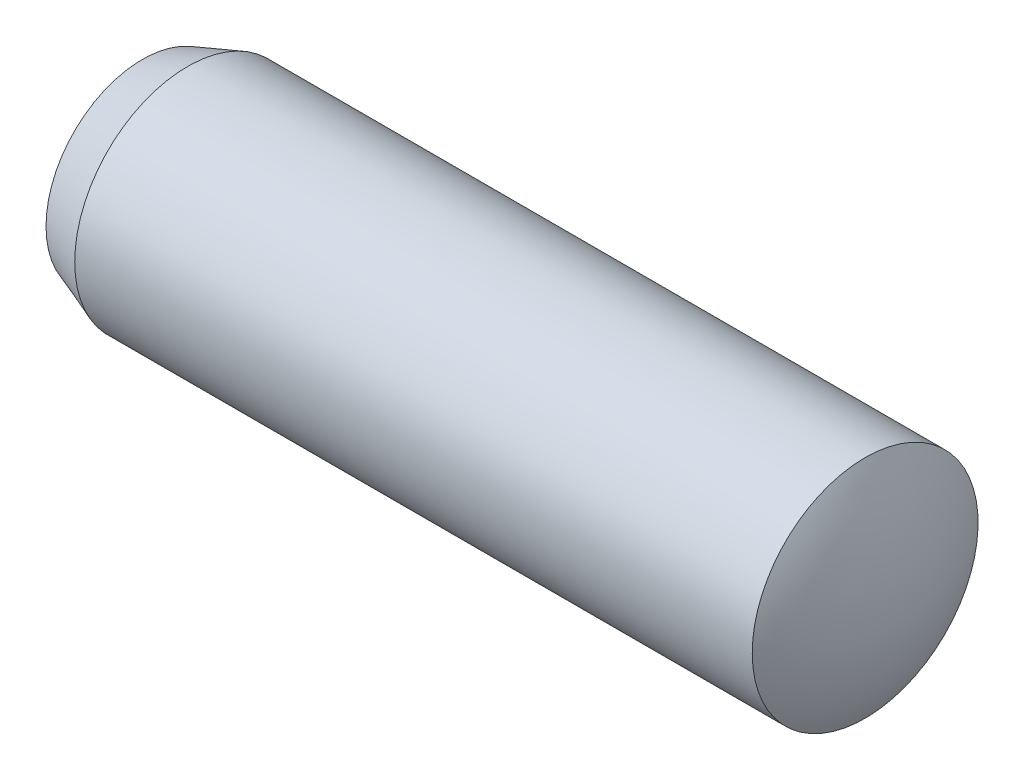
from build123d import *


with BuildPart() as part:
    # Esquisse1 → Base-R_volution (revolve)
    with BuildSketch(Plane.XY, mode=Mode.PRIVATE) as base_r_volution_sk:
        with BuildLine():
            Line((0, 0), (0, 2.563235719))
            Line((0, 2.563235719), (1.2, 3))
            Line((1.2, 3), (19.2, 3))
            ThreePointArc((19.2, 3), (19.796565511, 1.55241747), (20, 0))
            Line((20, 0), (0, 0))
        make_face()
    revolve(base_r_volution_sk.sketch.rotate(Axis((0, 0, 0), (1, 0, 0)), 90), axis=Axis((0, 0, 0), (1, 0, 0)))


solid = part.part
